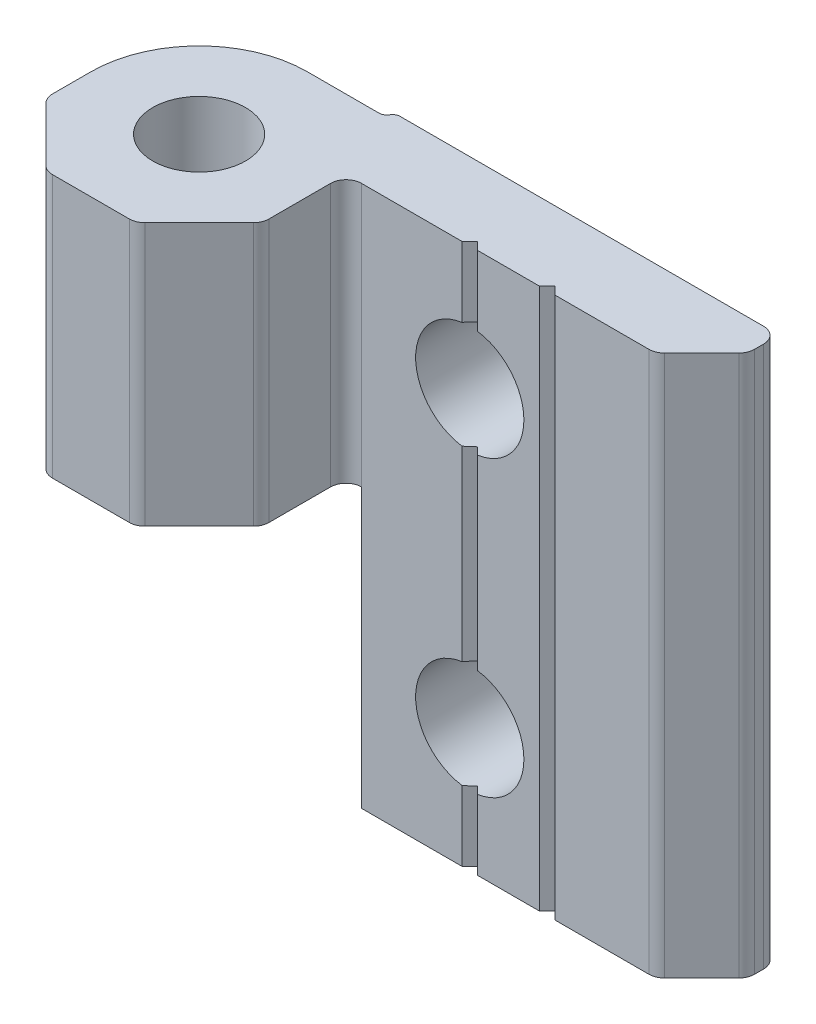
from build123d import *

# Parameters (mm, degrees)
SKETCH_1_R                = 3
EXTRUDE_1_DEPTH           = 35
SKETCH_2_W                = 32.756431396
SKETCH_2_H                = 31.923307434
CUT_EXTRUDE_1_DEPTH       = 35
HOLE_WIZARD_7_0_7_1_D     = 7
HOLE_WIZARD_7_0_7_1_DEPTH = 30
HOLE_WIZARD_7_0_7_1_TIP   = 2.103012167


with BuildPart() as part:
    # Sketch 1 → Extrude 1 (new body)
    with BuildSketch(Plane(origin=(0, 0, 0), x_dir=(1, 0, 0), z_dir=(0, 1, 0))):
        with BuildLine():
            Line((30, 5.914213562), (30, 6.5))
            ThreePointArc((30, 6.5), (29.707106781, 7.207106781), (29, 7.5))
            Line((29, 7.5), (5.5, 7.5))
            ThreePointArc((5.5, 7.5), (5.25, 7.433012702), (5.066987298, 7.25))
            ThreePointArc((5.066987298, 7.25), (4.883974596, 7.066987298), (4.633974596, 7))
            Line((4.633974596, 7), (0, 7))
            ThreePointArc((0, 7), (-4.949747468, 4.949747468), (-7, 0))
            Line((-7, 0), (-7, -2.485281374))
            ThreePointArc((-7, -2.485281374), (-6.923879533, -2.867964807), (-6.707106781, -3.192388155))
            Line((-6.707106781, -3.192388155), (-3.192388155, -6.707106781))
            ThreePointArc((-3.192388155, -6.707106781), (-2.867964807, -6.923879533), (-2.485281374, -7))
            Line((-2.485281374, -7), (2.485281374, -7))
            ThreePointArc((2.485281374, -7), (2.867964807, -6.923879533), (3.192388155, -6.707106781))
            Line((3.192388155, -6.707106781), (6.707106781, -3.192388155))
            ThreePointArc((6.707106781, -3.192388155), (6.923879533, -2.867964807), (7, -2.485281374))
            Line((7, -2.485281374), (7, 1.5))
            ThreePointArc((7, 1.5), (7.292893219, 2.207106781), (8, 2.5))
            Line((8, 2.5), (14.5, 2.5))
            Line((14.5, 2.5), (15, 3))
            Line((15, 3), (15.5, 2.5))
            Line((15.5, 2.5), (19.5, 2.5))
            Line((19.5, 2.5), (20, 3))
            Line((20, 3), (20.5, 2.5))
            Line((20.5, 2.5), (26.585786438, 2.5))
            ThreePointArc((26.585786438, 2.5), (26.96846987, 2.576120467), (27.292893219, 2.792893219))
            Line((27.292893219, 2.792893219), (29.707106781, 5.207106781))
            ThreePointArc((29.707106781, 5.207106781), (29.923879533, 5.53153013), (30, 5.914213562))
        make_face()
        with Locations(Location((0, 0, 0), (0, 0, 270))):
            Circle(SKETCH_1_R, mode=Mode.SUBTRACT)
    extrude(amount=EXTRUDE_1_DEPTH)

    # Sketch 2 → Cut-Extrude 1 (cut)
    with BuildSketch(Plane(origin=(0, 0, -7.5), x_dir=(-1, 0, 0), z_dir=(0, 0, -1))):
        with Locations((8.378215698, 2.038346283)):
            Rectangle(SKETCH_2_W, SKETCH_2_H)
    extrude(amount=-CUT_EXTRUDE_1_DEPTH, mode=Mode.SUBTRACT)

    # Hole Wizard 7.0 _7_ _1
    with Locations(Plane(origin=(15, 27, -2.5), x_dir=(1, 0, 0), z_dir=(0, 0, 1))):
        with Locations((0, 0), (0, -19)):
            Hole(HOLE_WIZARD_7_0_7_1_D / 2, depth=HOLE_WIZARD_7_0_7_1_DEPTH)
            with Locations((0, 0, -(HOLE_WIZARD_7_0_7_1_DEPTH + HOLE_WIZARD_7_0_7_1_TIP / 2))):  # 118° drill point
                Cone(0, HOLE_WIZARD_7_0_7_1_D / 2, HOLE_WIZARD_7_0_7_1_TIP, mode=Mode.SUBTRACT)


solid = part.part
